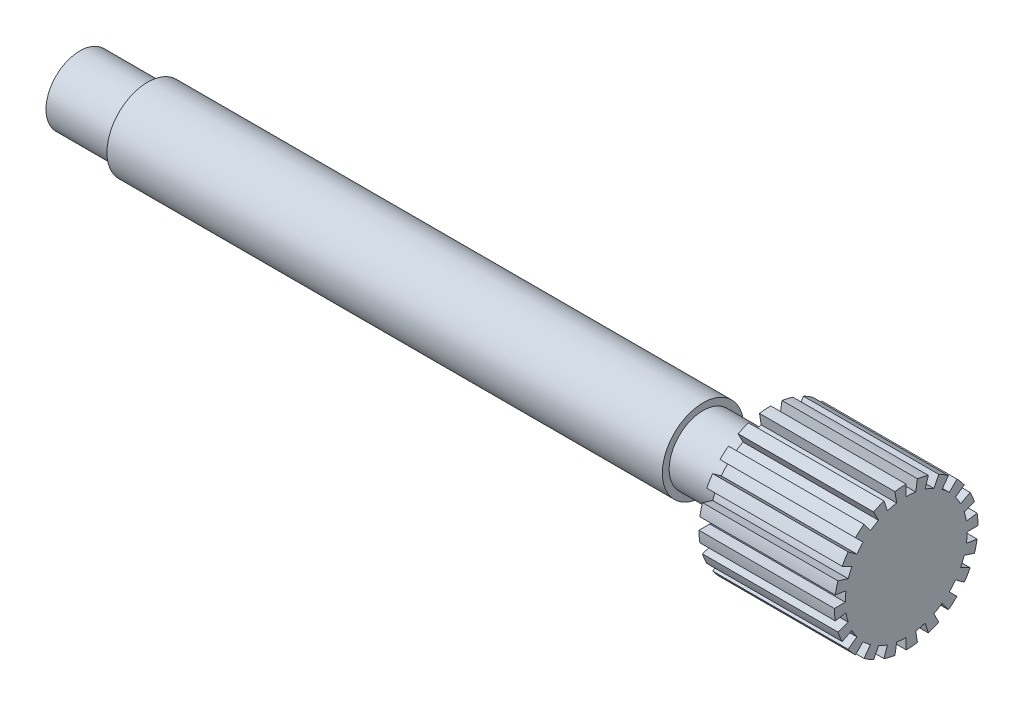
from build123d import *

# Parameters (mm, degrees)
EXTRUDE_1_DEPTH = 10


with BuildPart() as part:
    # Sketch 1 → Revolve 1 (revolve)
    with BuildSketch(Plane.XY, mode=Mode.PRIVATE) as revolve_1_sk:
        Polygon((46, 2.5), (61, 2.5), (61, 0), (0, 0), (0, 2.5), (5, 2.5), (5, 3), (46, 3), align=None)
    revolve(revolve_1_sk.sketch.rotate(Axis((-31.643438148, 0, 0), (1, 0, 0)), 90), axis=Axis((-31.643438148, 0, 0), (1, 0, 0)))

    # Sketch 3 → Extrude 1 (add)
    with BuildSketch(Plane(origin=(61, 0, 0), x_dir=(0, 0, -1), z_dir=(1, 0, 0))):
        with BuildLine():
            Line((4.444597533, 0.703955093), (5.234748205, 0.829102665))
            ThreePointArc((5.234748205, 0.829102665), (5.283661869, 0.415833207), (5.3, 0))
            Line((5.3, 0), (4.5, 0))
            ThreePointArc((4.5, 0), (4.486128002, -0.353065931), (4.444597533, -0.703955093))
            Line((4.444597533, -0.703955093), (5.234748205, -0.829102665))
            ThreePointArc((5.234748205, -0.829102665), (5.153560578, -1.237260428), (5.040599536, -1.63779007))
            Line((5.040599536, -1.63779007), (4.279754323, -1.390576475))
            ThreePointArc((4.279754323, -1.390576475), (4.157457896, -1.722075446), (4.009529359, -2.042957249))
            Line((4.009529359, -2.042957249), (4.722334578, -2.406149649))
            ThreePointArc((4.722334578, -2.406149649), (4.518992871, -2.769242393), (4.28779007, -3.115261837))
            Line((4.28779007, -3.115261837), (3.640576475, -2.645033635))
            ThreePointArc((3.640576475, -2.645033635), (3.421826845, -2.922516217), (3.181980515, -3.181980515))
            Line((3.181980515, -3.181980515), (3.74766594, -3.74766594))
            ThreePointArc((3.74766594, -3.74766594), (3.442074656, -4.030151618), (3.115261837, -4.28779007))
            Line((3.115261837, -4.28779007), (2.645033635, -3.640576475))
            ThreePointArc((2.645033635, -3.640576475), (2.351243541, -3.83688074), (2.042957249, -4.009529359))
            Line((2.042957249, -4.009529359), (2.406149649, -4.722334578))
            ThreePointArc((2.406149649, -4.722334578), (2.028222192, -4.896561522), (1.63779007, -5.040599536))
            Line((1.63779007, -5.040599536), (1.390576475, -4.279754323))
            ThreePointArc((1.390576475, -4.279754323), (1.050504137, -4.375664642), (0.703955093, -4.444597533))
            Line((0.703955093, -4.444597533), (0.829102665, -5.234748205))
            ThreePointArc((0.829102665, -5.234748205), (0.415833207, -5.283661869), (0, -5.3))
            Line((0, -5.3), (0, -4.5))
            ThreePointArc((0, -4.5), (-0.353065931, -4.486128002), (-0.703955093, -4.444597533))
            Line((-0.703955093, -4.444597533), (-0.829102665, -5.234748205))
            ThreePointArc((-0.829102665, -5.234748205), (-1.237260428, -5.153560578), (-1.63779007, -5.040599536))
            Line((-1.63779007, -5.040599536), (-1.390576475, -4.279754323))
            ThreePointArc((-1.390576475, -4.279754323), (-1.722075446, -4.157457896), (-2.042957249, -4.009529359))
            Line((-2.042957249, -4.009529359), (-2.406149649, -4.722334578))
            ThreePointArc((-2.406149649, -4.722334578), (-2.769242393, -4.518992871), (-3.115261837, -4.28779007))
            Line((-3.115261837, -4.28779007), (-2.645033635, -3.640576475))
            ThreePointArc((-2.645033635, -3.640576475), (-2.922516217, -3.421826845), (-3.181980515, -3.181980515))
            Line((-3.181980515, -3.181980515), (-3.74766594, -3.74766594))
            ThreePointArc((-3.74766594, -3.74766594), (-4.030151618, -3.442074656), (-4.28779007, -3.115261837))
            Line((-4.28779007, -3.115261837), (-3.640576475, -2.645033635))
            ThreePointArc((-3.640576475, -2.645033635), (-3.83688074, -2.351243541), (-4.009529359, -2.042957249))
            Line((-4.009529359, -2.042957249), (-4.722334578, -2.406149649))
            ThreePointArc((-4.722334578, -2.406149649), (-4.896561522, -2.028222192), (-5.040599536, -1.63779007))
            Line((-5.040599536, -1.63779007), (-4.279754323, -1.390576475))
            ThreePointArc((-4.279754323, -1.390576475), (-4.375664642, -1.050504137), (-4.444597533, -0.703955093))
            Line((-4.444597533, -0.703955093), (-5.234748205, -0.829102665))
            ThreePointArc((-5.234748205, -0.829102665), (-5.283661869, -0.415833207), (-5.3, 0))
            Line((-5.3, 0), (-4.5, 0))
            ThreePointArc((-4.5, 0), (-4.486128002, 0.353065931), (-4.444597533, 0.703955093))
            Line((-4.444597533, 0.703955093), (-5.234748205, 0.829102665))
            ThreePointArc((-5.234748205, 0.829102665), (-5.153560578, 1.237260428), (-5.040599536, 1.63779007))
            Line((-5.040599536, 1.63779007), (-4.279754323, 1.390576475))
            ThreePointArc((-4.279754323, 1.390576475), (-4.157457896, 1.722075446), (-4.009529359, 2.042957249))
            Line((-4.009529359, 2.042957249), (-4.722334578, 2.406149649))
            ThreePointArc((-4.722334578, 2.406149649), (-4.518992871, 2.769242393), (-4.28779007, 3.115261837))
            Line((-4.28779007, 3.115261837), (-3.640576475, 2.645033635))
            ThreePointArc((-3.640576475, 2.645033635), (-3.421826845, 2.922516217), (-3.181980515, 3.181980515))
            Line((-3.181980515, 3.181980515), (-3.74766594, 3.74766594))
            ThreePointArc((-3.74766594, 3.74766594), (-3.442074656, 4.030151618), (-3.115261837, 4.28779007))
            Line((-3.115261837, 4.28779007), (-2.645033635, 3.640576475))
            ThreePointArc((-2.645033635, 3.640576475), (-2.351243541, 3.83688074), (-2.042957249, 4.009529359))
            Line((-2.042957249, 4.009529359), (-2.406149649, 4.722334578))
            ThreePointArc((-2.406149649, 4.722334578), (-2.028222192, 4.896561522), (-1.63779007, 5.040599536))
            Line((-1.63779007, 5.040599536), (-1.390576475, 4.279754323))
            ThreePointArc((-1.390576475, 4.279754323), (-1.050504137, 4.375664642), (-0.703955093, 4.444597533))
            Line((-0.703955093, 4.444597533), (-0.829102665, 5.234748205))
            ThreePointArc((-0.829102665, 5.234748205), (-0.415833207, 5.283661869), (0, 5.3))
            Line((0, 5.3), (0, 4.5))
            ThreePointArc((0, 4.5), (0.353065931, 4.486128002), (0.703955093, 4.444597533))
            Line((0.703955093, 4.444597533), (0.829102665, 5.234748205))
            ThreePointArc((0.829102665, 5.234748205), (1.237260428, 5.153560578), (1.63779007, 5.040599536))
            Line((1.63779007, 5.040599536), (1.390576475, 4.279754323))
            ThreePointArc((1.390576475, 4.279754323), (1.722075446, 4.157457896), (2.042957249, 4.009529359))
            Line((2.042957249, 4.009529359), (2.406149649, 4.722334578))
            ThreePointArc((2.406149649, 4.722334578), (2.769242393, 4.518992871), (3.115261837, 4.28779007))
            Line((3.115261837, 4.28779007), (2.645033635, 3.640576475))
            ThreePointArc((2.645033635, 3.640576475), (2.922516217, 3.421826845), (3.181980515, 3.181980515))
            Line((3.181980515, 3.181980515), (3.74766594, 3.74766594))
            ThreePointArc((3.74766594, 3.74766594), (4.030151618, 3.442074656), (4.28779007, 3.115261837))
            Line((4.28779007, 3.115261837), (3.640576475, 2.645033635))
            ThreePointArc((3.640576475, 2.645033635), (3.83688074, 2.351243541), (4.009529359, 2.042957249))
            Line((4.009529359, 2.042957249), (4.722334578, 2.406149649))
            ThreePointArc((4.722334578, 2.406149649), (4.896561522, 2.028222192), (5.040599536, 1.63779007))
            Line((5.040599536, 1.63779007), (4.279754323, 1.390576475))
            ThreePointArc((4.279754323, 1.390576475), (4.375664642, 1.050504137), (4.444597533, 0.703955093))
        make_face()
    extrude(amount=-EXTRUDE_1_DEPTH)


solid = part.part
